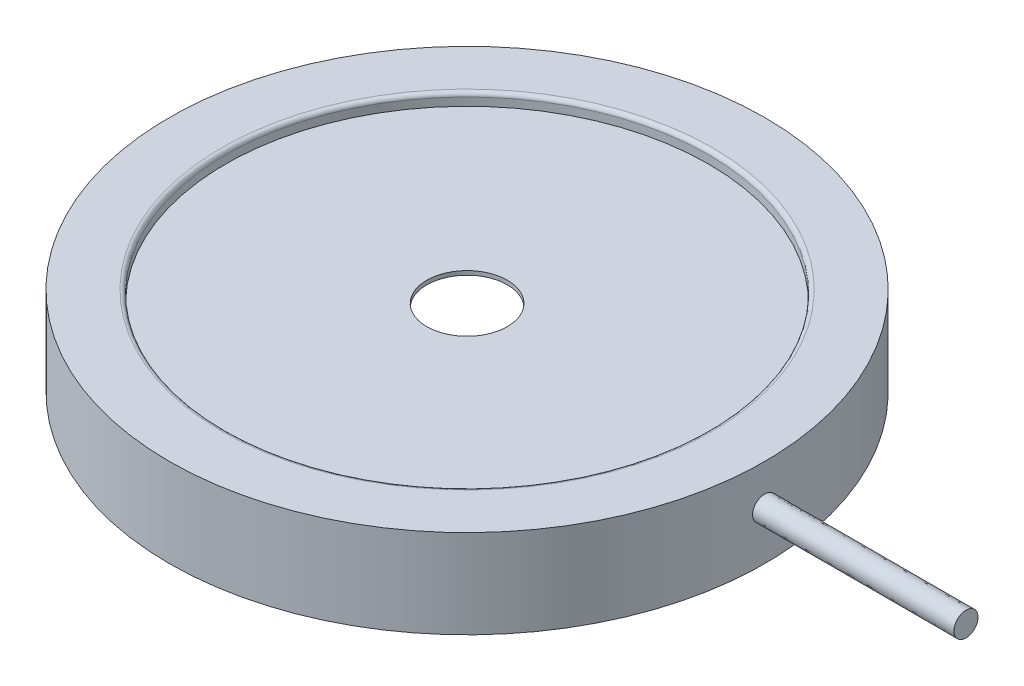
ISO-10303-21;
HEADER;
FILE_DESCRIPTION(('STEP AP214'),'2;1');
FILE_NAME('part.step','',(''),(''),'','','');
FILE_SCHEMA(('AUTOMOTIVE_DESIGN { 1 0 10303 214 1 1 1 1 }'));
ENDSEC;
DATA;
#1=APPLICATION_CONTEXT('core data for automotive mechanical design processes');
#2=APPLICATION_PROTOCOL_DEFINITION('international standard','automotive_design',2000,#1);
#3=PRODUCT_CONTEXT('',#1,'mechanical');
#4=PRODUCT('Part','Part','',(#3));
#5=PRODUCT_RELATED_PRODUCT_CATEGORY('part','',(#4));
#6=PRODUCT_DEFINITION_FORMATION('','',#4);
#7=PRODUCT_DEFINITION_CONTEXT('part definition',#1,'design');
#8=PRODUCT_DEFINITION('design','',#6,#7);
#9=PRODUCT_DEFINITION_SHAPE('','',#8);
#10=(LENGTH_UNIT() NAMED_UNIT(*) SI_UNIT(.MILLI.,.METRE.));
#11=(NAMED_UNIT(*) PLANE_ANGLE_UNIT() SI_UNIT($,.RADIAN.));
#12=(NAMED_UNIT(*) SI_UNIT($,.STERADIAN.) SOLID_ANGLE_UNIT());
#13=UNCERTAINTY_MEASURE_WITH_UNIT(LENGTH_MEASURE(1.E-05),#10,'distance_accuracy_value','');
#14=(GEOMETRIC_REPRESENTATION_CONTEXT(3) GLOBAL_UNCERTAINTY_ASSIGNED_CONTEXT((#13)) GLOBAL_UNIT_ASSIGNED_CONTEXT((#10,
#11,#12)) REPRESENTATION_CONTEXT('',''));
#15=CARTESIAN_POINT('',(0.,0.,0.));
#16=DIRECTION('',(0.,0.,1.));
#17=DIRECTION('',(1.,0.,0.));
#18=AXIS2_PLACEMENT_3D('',#15,#16,#17);
#19=CARTESIAN_POINT('',(0.,0.,0.));
#20=DIRECTION('',(0.,1.,0.));
#21=DIRECTION('',(0.,0.,1.));
#22=AXIS2_PLACEMENT_3D('',#19,#20,#21);
#23=CYLINDRICAL_SURFACE('',#22,2.5);
#24=CARTESIAN_POINT('',(0.,4.75,0.));
#25=DIRECTION('',(0.,1.,0.));
#26=DIRECTION('',(0.,0.,1.));
#27=AXIS2_PLACEMENT_3D('',#24,#25,#26);
#28=CIRCLE('',#27,2.5);
#29=CARTESIAN_POINT('',(0.,4.75,2.5));
#30=VERTEX_POINT('',#29);
#31=EDGE_CURVE('E53',#30,#30,#28,.T.);
#32=ORIENTED_EDGE('',*,*,#31,.T.);
#33=EDGE_LOOP('',(#32));
#34=FACE_BOUND('',#33,.T.);
#35=CARTESIAN_POINT('',(0.,4.5,0.));
#36=DIRECTION('',(0.,-1.,0.));
#37=DIRECTION('',(0.,0.,-1.));
#38=AXIS2_PLACEMENT_3D('',#35,#36,#37);
#39=CIRCLE('',#38,2.5);
#40=CARTESIAN_POINT('',(0.,4.5,-2.5));
#41=VERTEX_POINT('',#40);
#42=EDGE_CURVE('E50',#41,#41,#39,.F.);
#43=ORIENTED_EDGE('',*,*,#42,.F.);
#44=EDGE_LOOP('',(#43));
#45=FACE_BOUND('',#44,.T.);
#46=ADVANCED_FACE('F32',(#34,#45),#23,.F.);
#47=CARTESIAN_POINT('',(0.,5.5,0.));
#48=DIRECTION('',(0.,-1.,0.));
#49=DIRECTION('',(0.,0.,-1.));
#50=AXIS2_PLACEMENT_3D('',#47,#48,#49);
#51=CYLINDRICAL_SURFACE('',#50,18.5);
#52=CARTESIAN_POINT('',(18.4847933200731,2.99944124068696,-0.749943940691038));
#53=CARTESIAN_POINT('',(18.4847932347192,2.97844449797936,-0.749945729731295));
#54=CARTESIAN_POINT('',(18.4848286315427,2.95745022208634,-0.749075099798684));
#55=CARTESIAN_POINT('',(18.4849717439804,2.91560793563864,-0.745535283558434));
#56=CARTESIAN_POINT('',(18.4850794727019,2.89475995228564,-0.742865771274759));
#57=CARTESIAN_POINT('',(18.4853630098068,2.85334538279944,-0.735776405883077));
#58=CARTESIAN_POINT('',(18.4855388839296,2.83277908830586,-0.731354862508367));
#59=CARTESIAN_POINT('',(18.4859523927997,2.79208342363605,-0.720827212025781));
#60=CARTESIAN_POINT('',(18.4861900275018,2.77195405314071,-0.714721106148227));
#61=CARTESIAN_POINT('',(18.4867206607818,2.73227892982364,-0.700861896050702));
#62=CARTESIAN_POINT('',(18.4870136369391,2.71273294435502,-0.6931094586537));
#63=CARTESIAN_POINT('',(18.4876487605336,2.67437966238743,-0.675956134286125));
#64=CARTESIAN_POINT('',(18.4879909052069,2.65557232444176,-0.666555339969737));
#65=CARTESIAN_POINT('',(18.4887134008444,2.61882407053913,-0.646204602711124));
#66=CARTESIAN_POINT('',(18.4890937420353,2.60088293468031,-0.635255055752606));
#67=CARTESIAN_POINT('',(18.489881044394,2.56596601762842,-0.611911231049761));
#68=CARTESIAN_POINT('',(18.4902880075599,2.54899030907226,-0.599516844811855));
#69=CARTESIAN_POINT('',(18.4911190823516,2.51606178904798,-0.573312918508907));
#70=CARTESIAN_POINT('',(18.4915432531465,2.50011310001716,-0.559498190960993));
#71=CARTESIAN_POINT('',(18.4923965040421,2.46946504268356,-0.530547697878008));
#72=CARTESIAN_POINT('',(18.4928255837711,2.45476558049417,-0.515412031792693));
#73=CARTESIAN_POINT('',(18.4936756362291,2.42670191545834,-0.483951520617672));
#74=CARTESIAN_POINT('',(18.4940966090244,2.41333770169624,-0.467626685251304));
#75=CARTESIAN_POINT('',(18.494918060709,2.38800789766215,-0.433924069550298));
#76=CARTESIAN_POINT('',(18.4953185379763,2.37604241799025,-0.416546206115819));
#77=CARTESIAN_POINT('',(18.4960881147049,2.35359366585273,-0.380845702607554));
#78=CARTESIAN_POINT('',(18.4964572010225,2.3431110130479,-0.36252267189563));
#79=CARTESIAN_POINT('',(18.4971537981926,2.32376314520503,-0.325042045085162));
#80=CARTESIAN_POINT('',(18.4974813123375,2.31489780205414,-0.305884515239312));
#81=CARTESIAN_POINT('',(18.4980850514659,2.29882240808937,-0.266888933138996));
#82=CARTESIAN_POINT('',(18.4983612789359,2.29161227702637,-0.247050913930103));
#83=CARTESIAN_POINT('',(18.4988545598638,2.27886178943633,-0.206843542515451));
#84=CARTESIAN_POINT('',(18.4990716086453,2.27332156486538,-0.186474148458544));
#85=CARTESIAN_POINT('',(18.4994404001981,2.26395854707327,-0.14535281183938));
#86=CARTESIAN_POINT('',(18.4995921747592,2.26013491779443,-0.124601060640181));
#87=CARTESIAN_POINT('',(18.4998262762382,2.25428903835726,-0.0828460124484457));
#88=CARTESIAN_POINT('',(18.499908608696,2.25226664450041,-0.0618427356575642));
#89=CARTESIAN_POINT('',(18.5000014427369,2.25000735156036,-0.0197427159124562));
#90=CARTESIAN_POINT('',(18.5000119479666,2.24977036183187,0.00135402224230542));
#91=CARTESIAN_POINT('',(18.4999608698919,2.25104617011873,0.0434954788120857));
#92=CARTESIAN_POINT('',(18.4998992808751,2.25255910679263,0.0645401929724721));
#93=CARTESIAN_POINT('',(18.4997057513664,2.2573301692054,0.106420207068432));
#94=CARTESIAN_POINT('',(18.4995738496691,2.26058733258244,0.127255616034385));
#95=CARTESIAN_POINT('',(18.4992435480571,2.26888245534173,0.16856725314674));
#96=CARTESIAN_POINT('',(18.4990451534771,2.27392027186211,0.189043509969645));
#97=CARTESIAN_POINT('',(18.498587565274,2.28570935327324,0.229493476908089));
#98=CARTESIAN_POINT('',(18.4983283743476,2.29246054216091,0.249467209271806));
#99=CARTESIAN_POINT('',(18.4977563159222,2.30759459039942,0.288786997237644));
#100=CARTESIAN_POINT('',(18.4974434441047,2.31597758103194,0.308133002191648));
#101=CARTESIAN_POINT('',(18.4967726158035,2.33432670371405,0.346067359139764));
#102=CARTESIAN_POINT('',(18.4964146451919,2.34429333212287,0.364655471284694));
#103=CARTESIAN_POINT('',(18.4956644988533,2.36578850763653,0.400903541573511));
#104=CARTESIAN_POINT('',(18.495272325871,2.37731692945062,0.418563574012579));
#105=CARTESIAN_POINT('',(18.4944647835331,2.40182540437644,0.452842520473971));
#106=CARTESIAN_POINT('',(18.4940494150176,2.41480540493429,0.469461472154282));
#107=CARTESIAN_POINT('',(18.4932065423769,2.44209844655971,0.501567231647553));
#108=CARTESIAN_POINT('',(18.492779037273,2.45641159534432,0.51705394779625));
#109=CARTESIAN_POINT('',(18.491923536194,2.48628905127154,0.546795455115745));
#110=CARTESIAN_POINT('',(18.4914955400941,2.50185431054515,0.561049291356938));
#111=CARTESIAN_POINT('',(18.49065300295,2.53415390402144,0.588163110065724));
#112=CARTESIAN_POINT('',(18.4902384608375,2.55088814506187,0.601023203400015));
#113=CARTESIAN_POINT('',(18.4894341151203,2.58538389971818,0.625278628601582));
#114=CARTESIAN_POINT('',(18.4890443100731,2.60314535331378,0.636674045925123));
#115=CARTESIAN_POINT('',(18.4882992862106,2.63955349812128,0.657953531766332));
#116=CARTESIAN_POINT('',(18.4879440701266,2.65820025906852,0.667837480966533));
#117=CARTESIAN_POINT('',(18.4872782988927,2.69625543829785,0.686020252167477));
#118=CARTESIAN_POINT('',(18.4869677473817,2.71566391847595,0.694318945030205));
#119=CARTESIAN_POINT('',(18.4864023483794,2.75512335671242,0.709213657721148));
#120=CARTESIAN_POINT('',(18.4861474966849,2.77517426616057,0.715809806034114));
#121=CARTESIAN_POINT('',(18.4856998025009,2.81576186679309,0.727279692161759));
#122=CARTESIAN_POINT('',(18.4855069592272,2.83629855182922,0.732153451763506));
#123=CARTESIAN_POINT('',(18.4851872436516,2.87770605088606,0.740181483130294));
#124=CARTESIAN_POINT('',(18.4850603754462,2.89857688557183,0.743335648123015));
#125=CARTESIAN_POINT('',(18.4848765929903,2.94049728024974,0.747892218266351));
#126=CARTESIAN_POINT('',(18.4848196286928,2.96154670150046,0.749295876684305));
#127=CARTESIAN_POINT('',(18.4847792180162,3.00368142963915,0.750291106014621));
#128=CARTESIAN_POINT('',(18.4847957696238,3.0247667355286,0.749882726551));
#129=CARTESIAN_POINT('',(18.4849527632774,3.087855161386,0.746011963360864));
#130=CARTESIAN_POINT('',(18.4852003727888,3.12973081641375,0.739908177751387));
#131=CARTESIAN_POINT('',(18.4859580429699,3.21164485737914,0.720723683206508));
#132=CARTESIAN_POINT('',(18.4864670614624,3.25168985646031,0.707670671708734));
#133=CARTESIAN_POINT('',(18.4876828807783,3.32910155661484,0.675165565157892));
#134=CARTESIAN_POINT('',(18.4883896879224,3.36646817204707,0.655713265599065));
#135=CARTESIAN_POINT('',(18.4899332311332,3.43749176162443,0.610633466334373));
#136=CARTESIAN_POINT('',(18.4907705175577,3.47113193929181,0.584979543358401));
#137=CARTESIAN_POINT('',(18.4924715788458,3.53373213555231,0.528485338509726));
#138=CARTESIAN_POINT('',(18.4933353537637,3.56269214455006,0.497645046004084));
#139=CARTESIAN_POINT('',(18.4949977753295,3.61492127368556,0.431447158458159));
#140=CARTESIAN_POINT('',(18.4957963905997,3.6381876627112,0.396087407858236));
#141=CARTESIAN_POINT('',(18.4972343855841,3.6785820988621,0.32201703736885));
#142=CARTESIAN_POINT('',(18.4978737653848,3.69571014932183,0.283306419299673));
#143=CARTESIAN_POINT('',(18.498923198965,3.7230818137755,0.203534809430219));
#144=CARTESIAN_POINT('',(18.4993333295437,3.7333277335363,0.162474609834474));
#145=CARTESIAN_POINT('',(18.4998772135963,3.7469208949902,0.079225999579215));
#146=CARTESIAN_POINT('',(18.5000109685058,3.75026817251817,0.0370375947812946));
#147=CARTESIAN_POINT('',(18.4999876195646,3.74969185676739,-0.047259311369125));
#148=CARTESIAN_POINT('',(18.4998307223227,3.74577342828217,-0.089367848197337));
#149=CARTESIAN_POINT('',(18.4992435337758,3.73106428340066,-0.172365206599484));
#150=CARTESIAN_POINT('',(18.4988132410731,3.72027353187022,-0.21325402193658));
#151=CARTESIAN_POINT('',(18.4977288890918,3.69185771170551,-0.29258232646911));
#152=CARTESIAN_POINT('',(18.4970748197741,3.67423233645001,-0.331021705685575));
#153=CARTESIAN_POINT('',(18.4956142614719,3.63290197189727,-0.404474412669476));
#154=CARTESIAN_POINT('',(18.4948077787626,3.60919723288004,-0.43948788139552));
#155=CARTESIAN_POINT('',(18.4931363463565,3.5561337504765,-0.504964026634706));
#156=CARTESIAN_POINT('',(18.4922713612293,3.52677156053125,-0.535423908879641));
#157=CARTESIAN_POINT('',(18.4905751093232,3.46342508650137,-0.591104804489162));
#158=CARTESIAN_POINT('',(18.489743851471,3.42943958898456,-0.616324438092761));
#159=CARTESIAN_POINT('',(18.4882159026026,3.35763923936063,-0.660582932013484));
#160=CARTESIAN_POINT('',(18.4875192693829,3.31982275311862,-0.67961914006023));
#161=CARTESIAN_POINT('',(18.4863311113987,3.24157579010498,-0.711203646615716));
#162=CARTESIAN_POINT('',(18.485839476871,3.20114672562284,-0.72375541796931));
#163=CARTESIAN_POINT('',(18.4852554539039,3.13362224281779,-0.738486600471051));
#164=CARTESIAN_POINT('',(18.4850830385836,3.10697126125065,-0.742773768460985));
#165=CARTESIAN_POINT('',(18.4848520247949,3.05335925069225,-0.74850133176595));
#166=CARTESIAN_POINT('',(18.484793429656,3.02639821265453,-0.749941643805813));
#167=CARTESIAN_POINT('',(18.4847933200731,2.99944124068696,-0.749943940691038));
#168=B_SPLINE_CURVE_WITH_KNOTS('',3,(#52,#53,#54,#55,#56,#57,#58,#59,#60,#61,#62,#63,#64,#65,
#66,#67,#68,#69,#70,#71,#72,#73,#74,#75,#76,#77,#78,#79,#80,#81,#82,#83,#84,#85,#86,#87,#88,#89,
#90,#91,#92,#93,#94,#95,#96,#97,#98,#99,#100,#101,#102,#103,#104,#105,#106,#107,#108,#109,#110,
#111,#112,#113,#114,#115,#116,#117,#118,#119,#120,#121,#122,#123,#124,#125,#126,#127,#128,#129,
#130,#131,#132,#133,#134,#135,#136,#137,#138,#139,#140,#141,#142,#143,#144,#145,#146,#147,#148,
#149,#150,#151,#152,#153,#154,#155,#156,#157,#158,#159,#160,#161,#162,#163,#164,#165,#166,#167),
.UNSPECIFIED.,.T.,.F.,(4,2,2,2,2,2,2,2,2,2,2,2,2,2,2,2,2,2,2,2,2,2,2,2,2,2,2,2,2,2,2,2,2,2,2,2,
2,2,2,2,2,2,2,2,2,2,2,2,2,2,2,2,2,2,2,2,2,4),(0.,0.0629656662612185,0.12594274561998,
0.188980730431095,0.252018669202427,0.315031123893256,0.378040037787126,0.441032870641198,
0.504030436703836,0.567266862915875,0.630498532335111,0.693729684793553,0.75696583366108,
0.820228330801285,0.883485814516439,0.946740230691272,1.00999964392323,1.07322821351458,
1.13645173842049,1.199672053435,1.26289737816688,1.32608785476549,1.38927326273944,
1.45245586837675,1.5156435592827,1.57885109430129,1.64205356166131,1.70525374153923,
1.76845903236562,1.83171284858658,1.89496162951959,1.95820671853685,2.02145679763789,
2.08471202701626,2.14796248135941,2.21121213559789,2.27446571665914,2.33767398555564,
2.40088052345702,2.52717433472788,2.65296850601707,2.7787666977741,2.90511062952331,
3.03145482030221,3.15785949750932,3.28426410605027,3.41062634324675,3.53698792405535,
3.6632597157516,3.78953215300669,3.91581025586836,4.04208316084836,4.16843323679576,
4.29481653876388,4.4212539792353,4.54762363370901,4.62846065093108,4.70930003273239),.UNSPECIFIED.);
#169=CARTESIAN_POINT('',(18.4847933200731,2.99944124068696,-0.749943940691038));
#170=VERTEX_POINT('',#169);
#171=EDGE_CURVE('E36',#170,#170,#168,.F.);
#172=ORIENTED_EDGE('',*,*,#171,.F.);
#173=EDGE_LOOP('',(#172));
#174=FACE_BOUND('',#173,.T.);
#175=CARTESIAN_POINT('',(0.,5.5,0.));
#176=DIRECTION('',(0.,1.,0.));
#177=DIRECTION('',(0.,0.,1.));
#178=AXIS2_PLACEMENT_3D('',#175,#176,#177);
#179=CIRCLE('',#178,18.5);
#180=CARTESIAN_POINT('',(0.,5.5,18.5));
#181=VERTEX_POINT('',#180);
#182=EDGE_CURVE('E47',#181,#181,#179,.T.);
#183=ORIENTED_EDGE('',*,*,#182,.F.);
#184=EDGE_LOOP('',(#183));
#185=FACE_BOUND('',#184,.T.);
#186=CARTESIAN_POINT('',(0.,0.,0.));
#187=DIRECTION('',(0.,1.,0.));
#188=DIRECTION('',(0.,0.,1.));
#189=AXIS2_PLACEMENT_3D('',#186,#187,#188);
#190=CIRCLE('',#189,18.5);
#191=CARTESIAN_POINT('',(0.,0.,18.5));
#192=VERTEX_POINT('',#191);
#193=EDGE_CURVE('E55',#192,#192,#190,.T.);
#194=ORIENTED_EDGE('',*,*,#193,.T.);
#195=EDGE_LOOP('',(#194));
#196=FACE_BOUND('',#195,.T.);
#197=ADVANCED_FACE('F91',(#174,#185,#196),#51,.T.);
#198=CARTESIAN_POINT('',(0.,5.5,0.));
#199=DIRECTION('',(0.,1.,0.));
#200=DIRECTION('',(0.,0.,1.));
#201=AXIS2_PLACEMENT_3D('',#198,#199,#200);
#202=PLANE('',#201);
#203=CARTESIAN_POINT('',(0.,5.5,0.));
#204=DIRECTION('',(0.,1.,0.));
#205=DIRECTION('',(0.,0.,1.));
#206=AXIS2_PLACEMENT_3D('',#203,#204,#205);
#207=CIRCLE('',#206,15.25);
#208=CARTESIAN_POINT('',(0.,5.5,15.25));
#209=VERTEX_POINT('',#208);
#210=EDGE_CURVE('E11',#209,#209,#207,.F.);
#211=ORIENTED_EDGE('',*,*,#210,.T.);
#212=EDGE_LOOP('',(#211));
#213=FACE_BOUND('',#212,.T.);
#214=ORIENTED_EDGE('',*,*,#182,.T.);
#215=EDGE_LOOP('',(#214));
#216=FACE_BOUND('',#215,.T.);
#217=ADVANCED_FACE('F97',(#213,#216),#202,.T.);
#218=CARTESIAN_POINT('',(0.,0.,0.));
#219=DIRECTION('',(0.,1.,0.));
#220=DIRECTION('',(0.,0.,1.));
#221=AXIS2_PLACEMENT_3D('',#218,#219,#220);
#222=PLANE('',#221);
#223=CARTESIAN_POINT('',(0.,0.,0.));
#224=DIRECTION('',(0.,-1.,0.));
#225=DIRECTION('',(0.,0.,-1.));
#226=AXIS2_PLACEMENT_3D('',#223,#224,#225);
#227=CIRCLE('',#226,17.5);
#228=CARTESIAN_POINT('',(0.,0.,-17.5));
#229=VERTEX_POINT('',#228);
#230=EDGE_CURVE('E65',#229,#229,#227,.T.);
#231=ORIENTED_EDGE('',*,*,#230,.F.);
#232=EDGE_LOOP('',(#231));
#233=FACE_BOUND('',#232,.T.);
#234=ORIENTED_EDGE('',*,*,#193,.F.);
#235=EDGE_LOOP('',(#234));
#236=FACE_BOUND('',#235,.T.);
#237=ADVANCED_FACE('F111',(#233,#236),#222,.F.);
#238=CARTESIAN_POINT('',(0.,4.75,0.));
#239=DIRECTION('',(0.,1.,0.));
#240=DIRECTION('',(0.,0.,1.));
#241=AXIS2_PLACEMENT_3D('',#238,#239,#240);
#242=CYLINDRICAL_SURFACE('',#241,15.);
#243=CARTESIAN_POINT('',(0.,5.25,0.));
#244=DIRECTION('',(0.,1.,0.));
#245=DIRECTION('',(0.,0.,1.));
#246=AXIS2_PLACEMENT_3D('',#243,#244,#245);
#247=CIRCLE('',#246,15.);
#248=CARTESIAN_POINT('',(0.,5.25,15.));
#249=VERTEX_POINT('',#248);
#250=EDGE_CURVE('E43',#249,#249,#247,.T.);
#251=ORIENTED_EDGE('',*,*,#250,.T.);
#252=EDGE_LOOP('',(#251));
#253=FACE_BOUND('',#252,.T.);
#254=CARTESIAN_POINT('',(0.,4.75,0.));
#255=DIRECTION('',(0.,1.,0.));
#256=DIRECTION('',(0.,0.,1.));
#257=AXIS2_PLACEMENT_3D('',#254,#255,#256);
#258=CIRCLE('',#257,15.);
#259=CARTESIAN_POINT('',(0.,4.75,15.));
#260=VERTEX_POINT('',#259);
#261=EDGE_CURVE('E58',#260,#260,#258,.T.);
#262=ORIENTED_EDGE('',*,*,#261,.F.);
#263=EDGE_LOOP('',(#262));
#264=FACE_BOUND('',#263,.T.);
#265=ADVANCED_FACE('F107',(#253,#264),#242,.F.);
#266=CARTESIAN_POINT('',(0.,4.75,0.));
#267=DIRECTION('',(0.,1.,0.));
#268=DIRECTION('',(0.,0.,1.));
#269=AXIS2_PLACEMENT_3D('',#266,#267,#268);
#270=PLANE('',#269);
#271=ORIENTED_EDGE('',*,*,#31,.F.);
#272=EDGE_LOOP('',(#271));
#273=FACE_BOUND('',#272,.T.);
#274=ORIENTED_EDGE('',*,*,#261,.T.);
#275=EDGE_LOOP('',(#274));
#276=FACE_BOUND('',#275,.T.);
#277=ADVANCED_FACE('F103',(#273,#276),#270,.T.);
#278=CARTESIAN_POINT('',(0.,4.5,0.));
#279=DIRECTION('',(0.,-1.,0.));
#280=DIRECTION('',(0.,0.,-1.));
#281=AXIS2_PLACEMENT_3D('',#278,#279,#280);
#282=PLANE('',#281);
#283=CARTESIAN_POINT('',(0.,4.5,0.));
#284=DIRECTION('',(0.,-1.,0.));
#285=DIRECTION('',(0.,0.,-1.));
#286=AXIS2_PLACEMENT_3D('',#283,#284,#285);
#287=CIRCLE('',#286,17.5);
#288=CARTESIAN_POINT('',(0.,4.5,-17.5));
#289=VERTEX_POINT('',#288);
#290=EDGE_CURVE('E54',#289,#289,#287,.T.);
#291=ORIENTED_EDGE('',*,*,#290,.T.);
#292=EDGE_LOOP('',(#291));
#293=FACE_BOUND('',#292,.T.);
#294=ORIENTED_EDGE('',*,*,#42,.T.);
#295=EDGE_LOOP('',(#294));
#296=FACE_BOUND('',#295,.T.);
#297=ADVANCED_FACE('F106',(#293,#296),#282,.T.);
#298=CARTESIAN_POINT('',(0.,4.5,0.));
#299=DIRECTION('',(0.,-1.,0.));
#300=DIRECTION('',(0.,0.,-1.));
#301=AXIS2_PLACEMENT_3D('',#298,#299,#300);
#302=CYLINDRICAL_SURFACE('',#301,17.5);
#303=ORIENTED_EDGE('',*,*,#290,.F.);
#304=EDGE_LOOP('',(#303));
#305=FACE_BOUND('',#304,.T.);
#306=ORIENTED_EDGE('',*,*,#230,.T.);
#307=EDGE_LOOP('',(#306));
#308=FACE_BOUND('',#307,.T.);
#309=ADVANCED_FACE('F102',(#305,#308),#302,.F.);
#310=CARTESIAN_POINT('',(0.,5.25,0.));
#311=DIRECTION('',(0.,1.,0.));
#312=DIRECTION('',(0.,0.,1.));
#313=AXIS2_PLACEMENT_3D('',#310,#311,#312);
#314=TOROIDAL_SURFACE('',#313,15.25,0.25);
#315=ORIENTED_EDGE('',*,*,#210,.F.);
#316=EDGE_LOOP('',(#315));
#317=FACE_BOUND('',#316,.T.);
#318=ORIENTED_EDGE('',*,*,#250,.F.);
#319=EDGE_LOOP('',(#318));
#320=FACE_BOUND('',#319,.T.);
#321=ADVANCED_FACE('F34',(#317,#320),#314,.T.);
#322=CARTESIAN_POINT('',(18.4847910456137,3.,0.75));
#323=CARTESIAN_POINT('',(18.4847910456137,2.91609556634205,0.75));
#324=CARTESIAN_POINT('',(18.4853937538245,2.83103420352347,0.735519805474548));
#325=CARTESIAN_POINT('',(18.4864564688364,2.75186138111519,0.707762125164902));
#326=CARTESIAN_POINT('',(18.487519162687,2.67269013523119,0.680004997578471));
#327=CARTESIAN_POINT('',(18.4890626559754,2.5972239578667,0.638207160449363));
#328=CARTESIAN_POINT('',(18.490722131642,2.5316999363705,0.585828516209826));
#329=CARTESIAN_POINT('',(18.4923824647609,2.46614205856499,0.53342280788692));
#330=CARTESIAN_POINT('',(18.4941915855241,2.40872834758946,0.468980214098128));
#331=CARTESIAN_POINT('',(18.4957219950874,2.36420748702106,0.397828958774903));
#332=CARTESIAN_POINT('',(18.497252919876,2.31967163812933,0.326653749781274));
#333=CARTESIAN_POINT('',(18.4985350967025,2.28680929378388,0.246799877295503));
#334=CARTESIAN_POINT('',(18.4992652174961,2.26834872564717,0.16488302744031));
#335=CARTESIAN_POINT('',(18.4999949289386,2.24989850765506,0.0830121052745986));
#336=CARTESIAN_POINT('',(18.5001875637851,2.24532554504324,-0.00317897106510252));
#337=CARTESIAN_POINT('',(18.4997975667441,2.25501006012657,-0.0865447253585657));
#338=CARTESIAN_POINT('',(18.4994077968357,2.26468893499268,-0.169861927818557));
#339=CARTESIAN_POINT('',(18.498428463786,2.28887432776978,-0.252654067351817));
#340=CARTESIAN_POINT('',(18.4970908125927,2.32556058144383,-0.328072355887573));
#341=CARTESIAN_POINT('',(18.4957527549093,2.36225798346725,-0.403513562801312));
#342=CARTESIAN_POINT('',(18.4940298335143,2.4124741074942,-0.473656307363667));
#343=CARTESIAN_POINT('',(18.492328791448,2.47205669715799,-0.532706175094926));
#344=CARTESIAN_POINT('',(18.4906265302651,2.53168198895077,-0.591798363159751));
#345=CARTESIAN_POINT('',(18.4889126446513,2.60233255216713,-0.641411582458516));
#346=CARTESIAN_POINT('',(18.4875925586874,2.67816368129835,-0.677437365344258));
#347=CARTESIAN_POINT('',(18.486272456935,2.75399571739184,-0.713463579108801));
#348=CARTESIAN_POINT('',(18.4853202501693,2.83710249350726,-0.736895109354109));
#349=CARTESIAN_POINT('',(18.4849615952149,2.92059485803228,-0.74578470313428));
#350=CARTESIAN_POINT('',(18.484603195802,3.0040277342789,-0.754667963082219));
#351=CARTESIAN_POINT('',(18.4848304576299,3.09014727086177,-0.749274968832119));
#352=CARTESIAN_POINT('',(18.4855895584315,3.1718177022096,-0.730053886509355));
#353=CARTESIAN_POINT('',(18.4863484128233,3.25346162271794,-0.710839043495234));
#354=CARTESIAN_POINT('',(18.4876535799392,3.33290987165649,-0.677277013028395));
#355=CARTESIAN_POINT('',(18.4891965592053,3.4035955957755,-0.632147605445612));
#356=CARTESIAN_POINT('',(18.4907404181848,3.47432162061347,-0.586992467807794));
#357=CARTESIAN_POINT('',(18.4925527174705,3.53822536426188,-0.5290125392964));
#358=CARTESIAN_POINT('',(18.4942053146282,3.59002560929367,-0.463000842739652));
#359=CARTESIAN_POINT('',(18.4958588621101,3.64185564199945,-0.396951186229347));
#360=CARTESIAN_POINT('',(18.4973851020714,3.68299767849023,-0.321036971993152));
#361=CARTESIAN_POINT('',(18.4984230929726,3.71004008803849,-0.241543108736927));
#362=CARTESIAN_POINT('',(18.4994607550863,3.73707393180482,-0.162074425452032));
#363=CARTESIAN_POINT('',(18.5000308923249,3.75076204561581,-0.0768344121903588));
#364=CARTESIAN_POINT('',(18.4999986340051,3.74996630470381,0.00710927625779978));
#365=CARTESIAN_POINT('',(18.4999663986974,3.74917113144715,0.0909930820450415));
#366=CARTESIAN_POINT('',(18.4993320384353,3.73389146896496,0.175895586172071));
#367=CARTESIAN_POINT('',(18.4982454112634,3.70539584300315,0.254787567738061));
#368=CARTESIAN_POINT('',(18.4971587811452,3.67690013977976,0.33367976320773));
#369=CARTESIAN_POINT('',(18.4955985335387,3.63440456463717,0.408736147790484));
#370=CARTESIAN_POINT('',(18.4939329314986,3.58142520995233,0.473755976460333));
#371=CARTESIAN_POINT('',(18.4922661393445,3.52840800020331,0.538822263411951));
#372=CARTESIAN_POINT('',(18.4904609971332,3.46342994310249,0.595632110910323));
#373=CARTESIAN_POINT('',(18.488944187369,3.39186370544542,0.639486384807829));
#374=CARTESIAN_POINT('',(18.4874269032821,3.32027508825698,0.683354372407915));
#375=CARTESIAN_POINT('',(18.4861683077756,3.24011725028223,0.715468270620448));
#376=CARTESIAN_POINT('',(18.4854665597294,3.1580314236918,0.733161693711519));
#377=CARTESIAN_POINT('',(18.4850238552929,3.10624679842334,0.744323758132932));
#378=CARTESIAN_POINT('',(18.4847910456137,3.05297579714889,0.75));
#379=CARTESIAN_POINT('',(18.4847910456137,3.,0.75));
#380=B_SPLINE_CURVE_WITH_KNOTS('',3,(#322,#323,#324,#325,#326,#327,#328,#329,#330,#331,#332,
#333,#334,#335,#336,#337,#338,#339,#340,#341,#342,#343,#344,#345,#346,#347,#348,#349,#350,#351,
#352,#353,#354,#355,#356,#357,#358,#359,#360,#361,#362,#363,#364,#365,#366,#367,#368,#369,#370,
#371,#372,#373,#374,#375,#376,#377,#378,#379),.UNSPECIFIED.,.T.,.F.,(4,3,3,3,3,3,3,3,3,3,3,3,3,
3,3,3,3,3,3,4),(0.,0.0536744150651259,0.107346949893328,0.161047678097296,0.214767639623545,
0.26845722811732,0.322114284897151,0.37578734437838,0.429499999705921,0.483214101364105,
0.536889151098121,0.590545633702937,0.644232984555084,0.697952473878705,0.751655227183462,
0.805318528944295,0.858981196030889,0.912683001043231,0.966402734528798,1.),.UNSPECIFIED.);
#381=DIRECTION('',(1.,0.,0.));
#382=VECTOR('',#381,1.);
#383=SURFACE_OF_LINEAR_EXTRUSION('',#380,#382);
#384=CARTESIAN_POINT('',(30.9909260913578,3.,0.75));
#385=CARTESIAN_POINT('',(30.9909277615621,2.91591270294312,0.74998141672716));
#386=CARTESIAN_POINT('',(30.991285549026,2.83121898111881,0.735591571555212));
#387=CARTESIAN_POINT('',(30.9922383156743,2.71194783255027,0.693765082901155));
#388=CARTESIAN_POINT('',(30.9926263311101,2.67342319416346,0.676399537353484));
#389=CARTESIAN_POINT('',(30.993491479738,2.59970027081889,0.635545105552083));
#390=CARTESIAN_POINT('',(30.9939685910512,2.56450117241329,0.612057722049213));
#391=CARTESIAN_POINT('',(30.994963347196,2.49865153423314,0.559401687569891));
#392=CARTESIAN_POINT('',(30.9954810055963,2.46800252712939,0.530231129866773));
#393=CARTESIAN_POINT('',(30.9964946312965,2.4119120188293,0.467244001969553));
#394=CARTESIAN_POINT('',(30.9969905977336,2.38647072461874,0.433427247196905));
#395=CARTESIAN_POINT('',(30.9979076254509,2.34175661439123,0.36193071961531));
#396=CARTESIAN_POINT('',(30.9983286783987,2.32248448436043,0.324250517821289));
#397=CARTESIAN_POINT('',(30.999046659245,2.29039807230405,0.246232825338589));
#398=CARTESIAN_POINT('',(30.9993435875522,2.27758376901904,0.20589534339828));
#399=CARTESIAN_POINT('',(30.9997807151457,2.25905902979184,0.123628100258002));
#400=CARTESIAN_POINT('',(30.999920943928,2.25334725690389,0.0816986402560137));
#401=CARTESIAN_POINT('',(31.000028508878,2.24889513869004,-0.00252888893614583));
#402=CARTESIAN_POINT('',(30.9999958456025,2.25015477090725,-0.0448269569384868));
#403=CARTESIAN_POINT('',(30.9997616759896,2.25990135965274,-0.128572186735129));
#404=CARTESIAN_POINT('',(30.9995602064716,2.26838674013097,-0.170019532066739));
#405=CARTESIAN_POINT('',(30.9990105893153,2.29205490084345,-0.250954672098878));
#406=CARTESIAN_POINT('',(30.9986624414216,2.30723769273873,-0.290442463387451));
#407=CARTESIAN_POINT('',(30.9978598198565,2.34414357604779,-0.366236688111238));
#408=CARTESIAN_POINT('',(30.9974053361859,2.36586728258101,-0.40254282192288));
#409=CARTESIAN_POINT('',(30.9964392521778,2.41498729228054,-0.471089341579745));
#410=CARTESIAN_POINT('',(30.9959276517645,2.44238360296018,-0.503329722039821));
#411=CARTESIAN_POINT('',(30.9949078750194,2.50230161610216,-0.562649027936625));
#412=CARTESIAN_POINT('',(30.9943996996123,2.53482464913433,-0.589726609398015));
#413=CARTESIAN_POINT('',(30.9934400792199,2.60388107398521,-0.638165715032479));
#414=CARTESIAN_POINT('',(30.992988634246,2.64041446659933,-0.659527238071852));
#415=CARTESIAN_POINT('',(30.9921985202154,2.71660298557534,-0.695675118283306));
#416=CARTESIAN_POINT('',(30.9918598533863,2.75625817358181,-0.710461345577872));
#417=CARTESIAN_POINT('',(30.9913275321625,2.8374610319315,-0.733312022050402));
#418=CARTESIAN_POINT('',(30.9911338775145,2.87900869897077,-0.741376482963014));
#419=CARTESIAN_POINT('',(30.9909200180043,2.96286130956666,-0.750265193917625));
#420=CARTESIAN_POINT('',(30.9908997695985,3.00516606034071,-0.751091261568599));
#421=CARTESIAN_POINT('',(30.9910281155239,3.08933545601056,-0.745777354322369));
#422=CARTESIAN_POINT('',(30.9911767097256,3.13120010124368,-0.739637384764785));
#423=CARTESIAN_POINT('',(30.9916325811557,3.21325246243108,-0.720277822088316));
#424=CARTESIAN_POINT('',(30.9919398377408,3.25344039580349,-0.70705914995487));
#425=CARTESIAN_POINT('',(30.9926722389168,3.33109574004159,-0.674195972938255));
#426=CARTESIAN_POINT('',(30.9930973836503,3.36856314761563,-0.654551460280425));
#427=CARTESIAN_POINT('',(30.9940230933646,3.43958597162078,-0.60913163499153));
#428=CARTESIAN_POINT('',(30.994523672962,3.47314062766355,-0.583355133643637));
#429=CARTESIAN_POINT('',(30.9955393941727,3.5355553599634,-0.526636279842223));
#430=CARTESIAN_POINT('',(30.9960545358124,3.56441542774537,-0.495693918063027));
#431=CARTESIAN_POINT('',(30.9970447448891,3.61641410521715,-0.429315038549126));
#432=CARTESIAN_POINT('',(30.9975198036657,3.63955148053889,-0.393877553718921));
#433=CARTESIAN_POINT('',(30.9983739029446,3.6796843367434,-0.319679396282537));
#434=CARTESIAN_POINT('',(30.9987529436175,3.69667982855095,-0.280918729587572));
#435=CARTESIAN_POINT('',(30.9993736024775,3.72377614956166,-0.201061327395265));
#436=CARTESIAN_POINT('',(30.9996152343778,3.73387766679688,-0.159964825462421));
#437=CARTESIAN_POINT('',(30.9999331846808,3.74718603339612,-0.0766695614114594));
#438=CARTESIAN_POINT('',(31.0000095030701,3.75039288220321,-0.034470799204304));
#439=CARTESIAN_POINT('',(30.99998859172,3.74952835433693,0.0498410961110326));
#440=CARTESIAN_POINT('',(30.9998914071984,3.74545887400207,0.0919542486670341));
#441=CARTESIAN_POINT('',(30.999534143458,3.73045287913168,0.174937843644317));
#442=CARTESIAN_POINT('',(30.9992740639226,3.71951635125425,0.215808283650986));
#443=CARTESIAN_POINT('',(30.9986210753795,3.69080334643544,0.29507163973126));
#444=CARTESIAN_POINT('',(30.9982281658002,3.67302684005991,0.333464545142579));
#445=CARTESIAN_POINT('',(30.9973523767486,3.6314099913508,0.406801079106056));
#446=CARTESIAN_POINT('',(30.9968695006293,3.60756987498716,0.44174483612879));
#447=CARTESIAN_POINT('',(30.9958703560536,3.55423684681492,0.507046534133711));
#448=CARTESIAN_POINT('',(30.9953540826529,3.524743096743,0.537403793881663));
#449=CARTESIAN_POINT('',(30.9943432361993,3.46121924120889,0.592829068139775));
#450=CARTESIAN_POINT('',(30.9938486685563,3.42718801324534,0.617895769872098));
#451=CARTESIAN_POINT('',(30.9924889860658,3.31931444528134,0.68383097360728));
#452=CARTESIAN_POINT('',(30.9917435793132,3.23949583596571,0.715674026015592));
#453=CARTESIAN_POINT('',(30.9911934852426,3.13139929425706,0.738879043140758));
#454=CARTESIAN_POINT('',(30.9910942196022,3.10530534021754,0.743027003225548));
#455=CARTESIAN_POINT('',(30.9909602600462,3.05282758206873,0.748590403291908));
#456=CARTESIAN_POINT('',(30.9909255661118,3.02644377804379,0.750005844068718));
#457=CARTESIAN_POINT('',(30.9909260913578,3.,0.75));
#458=B_SPLINE_CURVE_WITH_KNOTS('',3,(#384,#385,#386,#387,#388,#389,#390,#391,#392,#393,#394,
#395,#396,#397,#398,#399,#400,#401,#402,#403,#404,#405,#406,#407,#408,#409,#410,#411,#412,#413,
#414,#415,#416,#417,#418,#419,#420,#421,#422,#423,#424,#425,#426,#427,#428,#429,#430,#431,#432,
#433,#434,#435,#436,#437,#438,#439,#440,#441,#442,#443,#444,#445,#446,#447,#448,#449,#450,#451,
#452,#453,#454,#455,#456,#457),.UNSPECIFIED.,.T.,.F.,(4,2,2,2,2,2,2,2,2,2,2,2,2,2,2,2,2,2,2,2,2,
2,2,2,2,2,2,2,2,2,2,2,2,2,2,2,4),(0.,0.251772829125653,0.378116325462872,0.504428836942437,
0.630783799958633,0.757143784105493,0.88351781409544,1.00989142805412,1.13624125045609,
1.26259066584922,1.38891252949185,1.51523461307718,1.64156857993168,1.76790271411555,
1.89426969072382,2.02063669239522,2.14700619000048,2.27337546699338,2.39971301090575,
2.5260504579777,2.65237147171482,2.77869263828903,2.90503831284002,3.03138421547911,
3.15775734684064,3.28413025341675,3.41049054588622,3.53685084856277,3.66317822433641,
3.78950584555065,3.91583401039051,4.04215746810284,4.16849967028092,4.29487318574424,
4.54673426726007,4.62591182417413,4.70508935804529),.UNSPECIFIED.);
#459=CARTESIAN_POINT('',(30.9909260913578,3.,0.75));
#460=VERTEX_POINT('',#459);
#461=EDGE_CURVE('E68',#460,#460,#458,.T.);
#462=ORIENTED_EDGE('',*,*,#461,.F.);
#463=EDGE_LOOP('',(#462));
#464=FACE_BOUND('',#463,.T.);
#465=ORIENTED_EDGE('',*,*,#171,.T.);
#466=EDGE_LOOP('',(#465));
#467=FACE_BOUND('',#466,.T.);
#468=ADVANCED_FACE('F79',(#464,#467),#383,.T.);
#469=CARTESIAN_POINT('',(0.,5.5,0.));
#470=DIRECTION('',(0.,-1.,0.));
#471=DIRECTION('',(0.,0.,-1.));
#472=AXIS2_PLACEMENT_3D('',#469,#470,#471);
#473=CYLINDRICAL_SURFACE('',#472,31.);
#474=ORIENTED_EDGE('',*,*,#461,.T.);
#475=EDGE_LOOP('',(#474));
#476=FACE_BOUND('',#475,.T.);
#477=ADVANCED_FACE('F82',(#476),#473,.T.);
#478=CLOSED_SHELL('',(#46,#197,#217,#237,#265,#277,#297,#309,#321,#468,#477));
#479=MANIFOLD_SOLID_BREP('B2',#478);
#480=ADVANCED_BREP_SHAPE_REPRESENTATION('',(#18,#479),#14);
#481=SHAPE_DEFINITION_REPRESENTATION(#9,#480);
ENDSEC;
END-ISO-10303-21;
